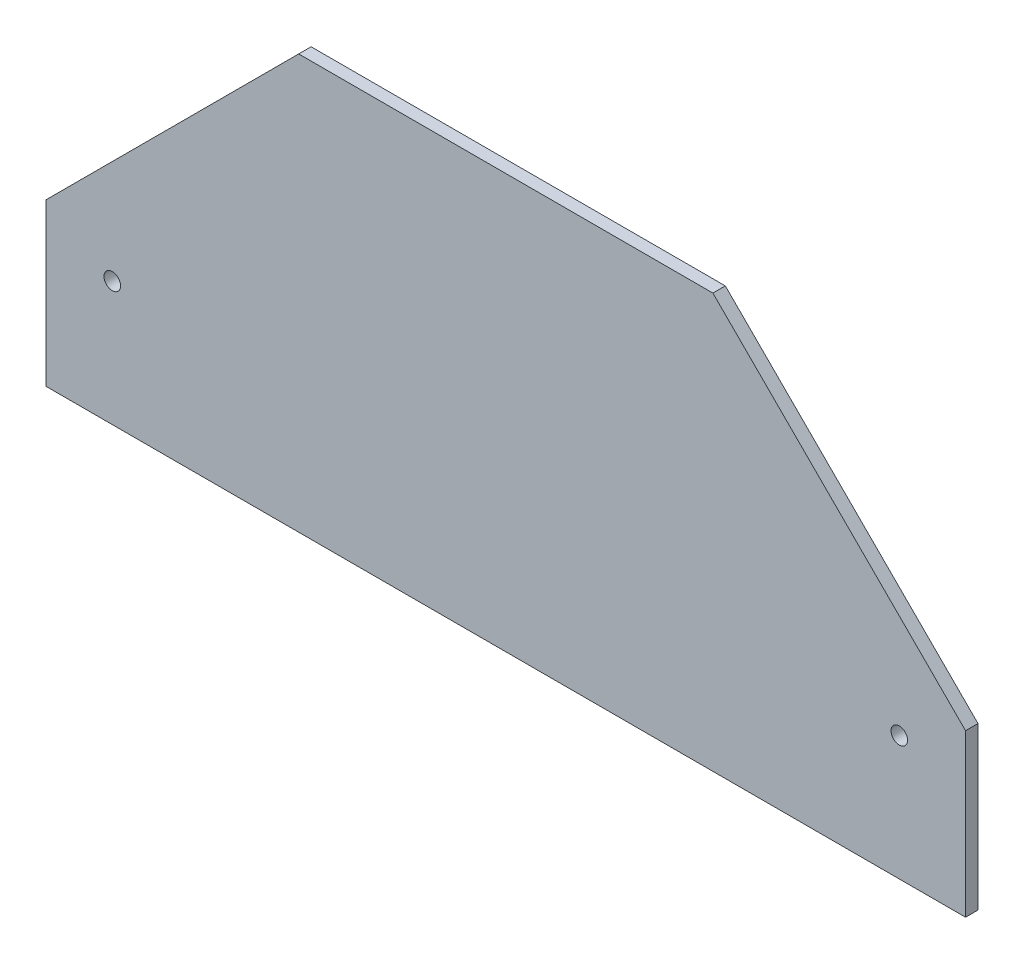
ISO-10303-21;
HEADER;
FILE_DESCRIPTION(('STEP AP214'),'2;1');
FILE_NAME('part.step','',(''),(''),'','','');
FILE_SCHEMA(('AUTOMOTIVE_DESIGN { 1 0 10303 214 1 1 1 1 }'));
ENDSEC;
DATA;
#1=APPLICATION_CONTEXT('core data for automotive mechanical design processes');
#2=APPLICATION_PROTOCOL_DEFINITION('international standard','automotive_design',2000,#1);
#3=PRODUCT_CONTEXT('',#1,'mechanical');
#4=PRODUCT('Part','Part','',(#3));
#5=PRODUCT_RELATED_PRODUCT_CATEGORY('part','',(#4));
#6=PRODUCT_DEFINITION_FORMATION('','',#4);
#7=PRODUCT_DEFINITION_CONTEXT('part definition',#1,'design');
#8=PRODUCT_DEFINITION('design','',#6,#7);
#9=PRODUCT_DEFINITION_SHAPE('','',#8);
#10=(LENGTH_UNIT() NAMED_UNIT(*) SI_UNIT(.MILLI.,.METRE.));
#11=(NAMED_UNIT(*) PLANE_ANGLE_UNIT() SI_UNIT($,.RADIAN.));
#12=(NAMED_UNIT(*) SI_UNIT($,.STERADIAN.) SOLID_ANGLE_UNIT());
#13=UNCERTAINTY_MEASURE_WITH_UNIT(LENGTH_MEASURE(1.E-05),#10,'distance_accuracy_value','');
#14=(GEOMETRIC_REPRESENTATION_CONTEXT(3) GLOBAL_UNCERTAINTY_ASSIGNED_CONTEXT((#13)) GLOBAL_UNIT_ASSIGNED_CONTEXT((#10,
#11,#12)) REPRESENTATION_CONTEXT('',''));
#15=CARTESIAN_POINT('',(0.,0.,0.));
#16=DIRECTION('',(0.,0.,1.));
#17=DIRECTION('',(1.,0.,0.));
#18=AXIS2_PLACEMENT_3D('',#15,#16,#17);
#19=CARTESIAN_POINT('',(0.,0.,15.));
#20=DIRECTION('',(0.,0.,-1.));
#21=DIRECTION('',(-1.,0.,0.));
#22=AXIS2_PLACEMENT_3D('',#19,#20,#21);
#23=PLANE('',#22);
#24=DIRECTION('',(0.,1.,0.));
#25=VECTOR('',#24,1.);
#26=CARTESIAN_POINT('',(555.,-250.,15.));
#27=LINE('',#26,#25);
#28=CARTESIAN_POINT('',(555.,-250.,15.));
#29=VERTEX_POINT('',#28);
#30=CARTESIAN_POINT('',(555.,-55.000000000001,15.));
#31=VERTEX_POINT('',#30);
#32=EDGE_CURVE('E108',#29,#31,#27,.T.);
#33=ORIENTED_EDGE('',*,*,#32,.T.);
#34=DIRECTION('',(-0.707106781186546,0.707106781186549,0.));
#35=VECTOR('',#34,1.);
#36=CARTESIAN_POINT('',(250.,250.,15.));
#37=LINE('',#36,#35);
#38=CARTESIAN_POINT('',(250.,250.,15.));
#39=VERTEX_POINT('',#38);
#40=EDGE_CURVE('E93',#31,#39,#37,.T.);
#41=ORIENTED_EDGE('',*,*,#40,.T.);
#42=DIRECTION('',(-1.,0.,0.));
#43=VECTOR('',#42,1.);
#44=CARTESIAN_POINT('',(-555.,250.,15.));
#45=LINE('',#44,#43);
#46=CARTESIAN_POINT('',(-250.,250.,15.));
#47=VERTEX_POINT('',#46);
#48=EDGE_CURVE('E117',#39,#47,#45,.T.);
#49=ORIENTED_EDGE('',*,*,#48,.T.);
#50=DIRECTION('',(-0.707106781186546,-0.707106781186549,0.));
#51=VECTOR('',#50,1.);
#52=CARTESIAN_POINT('',(-555.,-55.0000000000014,15.));
#53=LINE('',#52,#51);
#54=CARTESIAN_POINT('',(-555.,-55.0000000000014,15.));
#55=VERTEX_POINT('',#54);
#56=EDGE_CURVE('E102',#47,#55,#53,.T.);
#57=ORIENTED_EDGE('',*,*,#56,.T.);
#58=DIRECTION('',(0.,-1.,0.));
#59=VECTOR('',#58,1.);
#60=CARTESIAN_POINT('',(-555.,-250.,15.));
#61=LINE('',#60,#59);
#62=CARTESIAN_POINT('',(-555.,-250.,15.));
#63=VERTEX_POINT('',#62);
#64=EDGE_CURVE('E120',#55,#63,#61,.T.);
#65=ORIENTED_EDGE('',*,*,#64,.T.);
#66=DIRECTION('',(1.,0.,0.));
#67=VECTOR('',#66,1.);
#68=CARTESIAN_POINT('',(-555.,-250.,15.));
#69=LINE('',#68,#67);
#70=EDGE_CURVE('E115',#63,#29,#69,.T.);
#71=ORIENTED_EDGE('',*,*,#70,.T.);
#72=EDGE_LOOP('',(#33,#41,#49,#57,#65,#71));
#73=FACE_BOUND('',#72,.T.);
#74=CARTESIAN_POINT('',(-475.,-100.,15.));
#75=DIRECTION('',(0.,0.,1.));
#76=DIRECTION('',(1.,0.,0.));
#77=AXIS2_PLACEMENT_3D('',#74,#75,#76);
#78=CIRCLE('',#77,9.99999999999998);
#79=CARTESIAN_POINT('',(-465.,-100.,15.));
#80=VERTEX_POINT('',#79);
#81=EDGE_CURVE('E132',#80,#80,#78,.T.);
#82=ORIENTED_EDGE('',*,*,#81,.F.);
#83=EDGE_LOOP('',(#82));
#84=FACE_BOUND('',#83,.T.);
#85=CARTESIAN_POINT('',(475.,-99.9999999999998,15.));
#86=DIRECTION('',(0.,0.,1.));
#87=DIRECTION('',(1.,0.,0.));
#88=AXIS2_PLACEMENT_3D('',#85,#86,#87);
#89=CIRCLE('',#88,9.99999999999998);
#90=CARTESIAN_POINT('',(485.,-99.9999999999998,15.));
#91=VERTEX_POINT('',#90);
#92=EDGE_CURVE('E151',#91,#91,#89,.T.);
#93=ORIENTED_EDGE('',*,*,#92,.F.);
#94=EDGE_LOOP('',(#93));
#95=FACE_BOUND('',#94,.T.);
#96=ADVANCED_FACE('F42',(#73,#84,#95),#23,.F.);
#97=CARTESIAN_POINT('',(0.,0.,0.));
#98=DIRECTION('',(0.,0.,-1.));
#99=DIRECTION('',(-1.,0.,0.));
#100=AXIS2_PLACEMENT_3D('',#97,#98,#99);
#101=PLANE('',#100);
#102=DIRECTION('',(-0.707106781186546,0.707106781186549,0.));
#103=VECTOR('',#102,1.);
#104=CARTESIAN_POINT('',(250.,250.,0.));
#105=LINE('',#104,#103);
#106=CARTESIAN_POINT('',(555.,-55.000000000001,0.));
#107=VERTEX_POINT('',#106);
#108=CARTESIAN_POINT('',(250.,250.,0.));
#109=VERTEX_POINT('',#108);
#110=EDGE_CURVE('E57',#107,#109,#105,.T.);
#111=ORIENTED_EDGE('',*,*,#110,.F.);
#112=DIRECTION('',(0.,1.,0.));
#113=VECTOR('',#112,1.);
#114=CARTESIAN_POINT('',(555.,-250.,0.));
#115=LINE('',#114,#113);
#116=CARTESIAN_POINT('',(555.,-250.,0.));
#117=VERTEX_POINT('',#116);
#118=EDGE_CURVE('E110',#117,#107,#115,.T.);
#119=ORIENTED_EDGE('',*,*,#118,.F.);
#120=DIRECTION('',(1.,0.,0.));
#121=VECTOR('',#120,1.);
#122=CARTESIAN_POINT('',(-555.,-250.,0.));
#123=LINE('',#122,#121);
#124=CARTESIAN_POINT('',(-555.,-250.,0.));
#125=VERTEX_POINT('',#124);
#126=EDGE_CURVE('E118',#125,#117,#123,.T.);
#127=ORIENTED_EDGE('',*,*,#126,.F.);
#128=DIRECTION('',(0.,-1.,0.));
#129=VECTOR('',#128,1.);
#130=CARTESIAN_POINT('',(-555.,-250.,0.));
#131=LINE('',#130,#129);
#132=CARTESIAN_POINT('',(-555.,-55.0000000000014,0.));
#133=VERTEX_POINT('',#132);
#134=EDGE_CURVE('E122',#133,#125,#131,.T.);
#135=ORIENTED_EDGE('',*,*,#134,.F.);
#136=DIRECTION('',(-0.707106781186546,-0.707106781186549,0.));
#137=VECTOR('',#136,1.);
#138=CARTESIAN_POINT('',(-555.,-55.0000000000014,0.));
#139=LINE('',#138,#137);
#140=CARTESIAN_POINT('',(-250.,250.,0.));
#141=VERTEX_POINT('',#140);
#142=EDGE_CURVE('E65',#141,#133,#139,.T.);
#143=ORIENTED_EDGE('',*,*,#142,.F.);
#144=DIRECTION('',(-1.,0.,0.));
#145=VECTOR('',#144,1.);
#146=CARTESIAN_POINT('',(-555.,250.,0.));
#147=LINE('',#146,#145);
#148=EDGE_CURVE('E131',#109,#141,#147,.T.);
#149=ORIENTED_EDGE('',*,*,#148,.F.);
#150=EDGE_LOOP('',(#111,#119,#127,#135,#143,#149));
#151=FACE_BOUND('',#150,.T.);
#152=CARTESIAN_POINT('',(-475.,-100.,0.));
#153=DIRECTION('',(0.,0.,1.));
#154=DIRECTION('',(1.,0.,0.));
#155=AXIS2_PLACEMENT_3D('',#152,#153,#154);
#156=CIRCLE('',#155,9.99999999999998);
#157=CARTESIAN_POINT('',(-465.,-100.,0.));
#158=VERTEX_POINT('',#157);
#159=EDGE_CURVE('E125',#158,#158,#156,.T.);
#160=ORIENTED_EDGE('',*,*,#159,.T.);
#161=EDGE_LOOP('',(#160));
#162=FACE_BOUND('',#161,.T.);
#163=CARTESIAN_POINT('',(475.,-99.9999999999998,0.));
#164=DIRECTION('',(0.,0.,1.));
#165=DIRECTION('',(1.,0.,0.));
#166=AXIS2_PLACEMENT_3D('',#163,#164,#165);
#167=CIRCLE('',#166,9.99999999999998);
#168=CARTESIAN_POINT('',(485.,-99.9999999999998,0.));
#169=VERTEX_POINT('',#168);
#170=EDGE_CURVE('E111',#169,#169,#167,.T.);
#171=ORIENTED_EDGE('',*,*,#170,.T.);
#172=EDGE_LOOP('',(#171));
#173=FACE_BOUND('',#172,.T.);
#174=ADVANCED_FACE('F138',(#151,#162,#173),#101,.T.);
#175=CARTESIAN_POINT('',(555.,-250.,15.));
#176=DIRECTION('',(-1.,0.,0.));
#177=DIRECTION('',(0.,0.,1.));
#178=AXIS2_PLACEMENT_3D('',#175,#176,#177);
#179=PLANE('',#178);
#180=ORIENTED_EDGE('',*,*,#118,.T.);
#181=DIRECTION('',(0.,0.,-1.));
#182=VECTOR('',#181,1.);
#183=CARTESIAN_POINT('',(555.,-55.000000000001,15.));
#184=LINE('',#183,#182);
#185=EDGE_CURVE('E96',#31,#107,#184,.T.);
#186=ORIENTED_EDGE('',*,*,#185,.F.);
#187=ORIENTED_EDGE('',*,*,#32,.F.);
#188=DIRECTION('',(0.,0.,-1.));
#189=VECTOR('',#188,1.);
#190=CARTESIAN_POINT('',(555.,-250.,15.));
#191=LINE('',#190,#189);
#192=EDGE_CURVE('E50',#29,#117,#191,.T.);
#193=ORIENTED_EDGE('',*,*,#192,.T.);
#194=EDGE_LOOP('',(#180,#186,#187,#193));
#195=FACE_BOUND('',#194,.T.);
#196=ADVANCED_FACE('F44',(#195),#179,.F.);
#197=CARTESIAN_POINT('',(-555.,250.,15.));
#198=DIRECTION('',(0.,-1.,0.));
#199=DIRECTION('',(0.,0.,-1.));
#200=AXIS2_PLACEMENT_3D('',#197,#198,#199);
#201=PLANE('',#200);
#202=ORIENTED_EDGE('',*,*,#48,.F.);
#203=DIRECTION('',(0.,0.,-1.));
#204=VECTOR('',#203,1.);
#205=CARTESIAN_POINT('',(250.,250.,15.));
#206=LINE('',#205,#204);
#207=EDGE_CURVE('E97',#39,#109,#206,.T.);
#208=ORIENTED_EDGE('',*,*,#207,.T.);
#209=ORIENTED_EDGE('',*,*,#148,.T.);
#210=DIRECTION('',(0.,0.,-1.));
#211=VECTOR('',#210,1.);
#212=CARTESIAN_POINT('',(-250.,250.,15.));
#213=LINE('',#212,#211);
#214=EDGE_CURVE('E148',#47,#141,#213,.T.);
#215=ORIENTED_EDGE('',*,*,#214,.F.);
#216=EDGE_LOOP('',(#202,#208,#209,#215));
#217=FACE_BOUND('',#216,.T.);
#218=ADVANCED_FACE('F184',(#217),#201,.F.);
#219=CARTESIAN_POINT('',(-555.,-250.,15.));
#220=DIRECTION('',(1.,0.,0.));
#221=DIRECTION('',(0.,0.,-1.));
#222=AXIS2_PLACEMENT_3D('',#219,#220,#221);
#223=PLANE('',#222);
#224=ORIENTED_EDGE('',*,*,#64,.F.);
#225=DIRECTION('',(0.,0.,-1.));
#226=VECTOR('',#225,1.);
#227=CARTESIAN_POINT('',(-555.,-55.0000000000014,15.));
#228=LINE('',#227,#226);
#229=EDGE_CURVE('E146',#55,#133,#228,.T.);
#230=ORIENTED_EDGE('',*,*,#229,.T.);
#231=ORIENTED_EDGE('',*,*,#134,.T.);
#232=DIRECTION('',(0.,0.,-1.));
#233=VECTOR('',#232,1.);
#234=CARTESIAN_POINT('',(-555.,-250.,15.));
#235=LINE('',#234,#233);
#236=EDGE_CURVE('E12',#63,#125,#235,.T.);
#237=ORIENTED_EDGE('',*,*,#236,.F.);
#238=EDGE_LOOP('',(#224,#230,#231,#237));
#239=FACE_BOUND('',#238,.T.);
#240=ADVANCED_FACE('F174',(#239),#223,.F.);
#241=CARTESIAN_POINT('',(-555.,-250.,15.));
#242=DIRECTION('',(0.,1.,0.));
#243=DIRECTION('',(0.,0.,1.));
#244=AXIS2_PLACEMENT_3D('',#241,#242,#243);
#245=PLANE('',#244);
#246=ORIENTED_EDGE('',*,*,#126,.T.);
#247=ORIENTED_EDGE('',*,*,#192,.F.);
#248=ORIENTED_EDGE('',*,*,#70,.F.);
#249=ORIENTED_EDGE('',*,*,#236,.T.);
#250=EDGE_LOOP('',(#246,#247,#248,#249));
#251=FACE_BOUND('',#250,.T.);
#252=ADVANCED_FACE('F165',(#251),#245,.F.);
#253=CARTESIAN_POINT('',(-475.,-100.,15.));
#254=DIRECTION('',(0.,0.,-1.));
#255=DIRECTION('',(-1.,0.,0.));
#256=AXIS2_PLACEMENT_3D('',#253,#254,#255);
#257=CYLINDRICAL_SURFACE('',#256,9.99999999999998);
#258=ORIENTED_EDGE('',*,*,#81,.T.);
#259=EDGE_LOOP('',(#258));
#260=FACE_BOUND('',#259,.T.);
#261=ORIENTED_EDGE('',*,*,#159,.F.);
#262=EDGE_LOOP('',(#261));
#263=FACE_BOUND('',#262,.T.);
#264=ADVANCED_FACE('F162',(#260,#263),#257,.F.);
#265=CARTESIAN_POINT('',(475.,-99.9999999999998,15.));
#266=DIRECTION('',(0.,0.,-1.));
#267=DIRECTION('',(-1.,0.,0.));
#268=AXIS2_PLACEMENT_3D('',#265,#266,#267);
#269=CYLINDRICAL_SURFACE('',#268,9.99999999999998);
#270=ORIENTED_EDGE('',*,*,#92,.T.);
#271=EDGE_LOOP('',(#270));
#272=FACE_BOUND('',#271,.T.);
#273=ORIENTED_EDGE('',*,*,#170,.F.);
#274=EDGE_LOOP('',(#273));
#275=FACE_BOUND('',#274,.T.);
#276=ADVANCED_FACE('F164',(#272,#275),#269,.F.);
#277=CARTESIAN_POINT('',(-555.,-55.0000000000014,15.));
#278=DIRECTION('',(0.707106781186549,-0.707106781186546,0.));
#279=DIRECTION('',(0.707106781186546,0.707106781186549,0.));
#280=AXIS2_PLACEMENT_3D('',#277,#278,#279);
#281=PLANE('',#280);
#282=ORIENTED_EDGE('',*,*,#142,.T.);
#283=ORIENTED_EDGE('',*,*,#229,.F.);
#284=ORIENTED_EDGE('',*,*,#56,.F.);
#285=ORIENTED_EDGE('',*,*,#214,.T.);
#286=EDGE_LOOP('',(#282,#283,#284,#285));
#287=FACE_BOUND('',#286,.T.);
#288=ADVANCED_FACE('F171',(#287),#281,.F.);
#289=CARTESIAN_POINT('',(250.,250.,15.));
#290=DIRECTION('',(-0.707106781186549,-0.707106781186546,0.));
#291=DIRECTION('',(0.707106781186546,-0.707106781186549,0.));
#292=AXIS2_PLACEMENT_3D('',#289,#290,#291);
#293=PLANE('',#292);
#294=ORIENTED_EDGE('',*,*,#110,.T.);
#295=ORIENTED_EDGE('',*,*,#207,.F.);
#296=ORIENTED_EDGE('',*,*,#40,.F.);
#297=ORIENTED_EDGE('',*,*,#185,.T.);
#298=EDGE_LOOP('',(#294,#295,#296,#297));
#299=FACE_BOUND('',#298,.T.);
#300=ADVANCED_FACE('F95',(#299),#293,.F.);
#301=CLOSED_SHELL('',(#96,#174,#196,#218,#240,#252,#264,#276,#288,#300));
#302=MANIFOLD_SOLID_BREP('B2',#301);
#303=ADVANCED_BREP_SHAPE_REPRESENTATION('',(#18,#302),#14);
#304=SHAPE_DEFINITION_REPRESENTATION(#9,#303);
ENDSEC;
END-ISO-10303-21;
